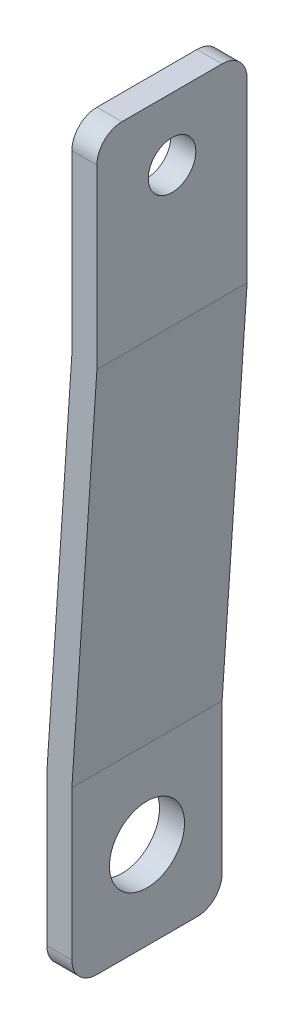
ISO-10303-21;
HEADER;
FILE_DESCRIPTION(('STEP AP214'),'2;1');
FILE_NAME('part.step','',(''),(''),'','','');
FILE_SCHEMA(('AUTOMOTIVE_DESIGN { 1 0 10303 214 1 1 1 1 }'));
ENDSEC;
DATA;
#1=APPLICATION_CONTEXT('core data for automotive mechanical design processes');
#2=APPLICATION_PROTOCOL_DEFINITION('international standard','automotive_design',2000,#1);
#3=PRODUCT_CONTEXT('',#1,'mechanical');
#4=PRODUCT('Part','Part','',(#3));
#5=PRODUCT_RELATED_PRODUCT_CATEGORY('part','',(#4));
#6=PRODUCT_DEFINITION_FORMATION('','',#4);
#7=PRODUCT_DEFINITION_CONTEXT('part definition',#1,'design');
#8=PRODUCT_DEFINITION('design','',#6,#7);
#9=PRODUCT_DEFINITION_SHAPE('','',#8);
#10=(LENGTH_UNIT() NAMED_UNIT(*) SI_UNIT(.MILLI.,.METRE.));
#11=(NAMED_UNIT(*) PLANE_ANGLE_UNIT() SI_UNIT($,.RADIAN.));
#12=(NAMED_UNIT(*) SI_UNIT($,.STERADIAN.) SOLID_ANGLE_UNIT());
#13=UNCERTAINTY_MEASURE_WITH_UNIT(LENGTH_MEASURE(1.E-05),#10,'distance_accuracy_value','');
#14=(GEOMETRIC_REPRESENTATION_CONTEXT(3) GLOBAL_UNCERTAINTY_ASSIGNED_CONTEXT((#13)) GLOBAL_UNIT_ASSIGNED_CONTEXT((#10,
#11,#12)) REPRESENTATION_CONTEXT('',''));
#15=CARTESIAN_POINT('',(0.,0.,0.));
#16=DIRECTION('',(0.,0.,1.));
#17=DIRECTION('',(1.,0.,0.));
#18=AXIS2_PLACEMENT_3D('',#15,#16,#17);
#19=CARTESIAN_POINT('',(-9.99999999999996,-229.999999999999,59.9999999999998));
#20=DIRECTION('',(0.999999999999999,0.,0.));
#21=DIRECTION('',(0.,1.,0.));
#22=AXIS2_PLACEMENT_3D('',#19,#20,#21);
#23=PLANE('',#22);
#24=CARTESIAN_POINT('',(-9.99999999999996,-265.000000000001,29.9999999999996));
#25=DIRECTION('',(0.999999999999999,0.,0.));
#26=DIRECTION('',(0.,1.,0.));
#27=AXIS2_PLACEMENT_3D('',#24,#25,#26);
#28=CIRCLE('',#27,15.);
#29=CARTESIAN_POINT('',(-9.99999999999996,-250.000000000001,29.9999999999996));
#30=VERTEX_POINT('',#29);
#31=EDGE_CURVE('E228',#30,#30,#28,.T.);
#32=ORIENTED_EDGE('',*,*,#31,.T.);
#33=EDGE_LOOP('',(#32));
#34=FACE_BOUND('',#33,.T.);
#35=DIRECTION('',(0.,-1.,0.));
#36=VECTOR('',#35,1.);
#37=CARTESIAN_POINT('',(-9.99999999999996,-230.,0.));
#38=LINE('',#37,#36);
#39=CARTESIAN_POINT('',(-9.99999999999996,-230.,0.));
#40=VERTEX_POINT('',#39);
#41=CARTESIAN_POINT('',(-9.99999999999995,-290.,2.22044604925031E-13));
#42=VERTEX_POINT('',#41);
#43=EDGE_CURVE('E156',#40,#42,#38,.T.);
#44=ORIENTED_EDGE('',*,*,#43,.T.);
#45=CARTESIAN_POINT('',(-9.99999999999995,-290.,9.99999999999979));
#46=DIRECTION('',(0.999999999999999,0.,0.));
#47=DIRECTION('',(0.,1.,0.));
#48=AXIS2_PLACEMENT_3D('',#45,#46,#47);
#49=CIRCLE('',#48,10.);
#50=CARTESIAN_POINT('',(-9.99999999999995,-300.,9.99999999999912));
#51=VERTEX_POINT('',#50);
#52=EDGE_CURVE('E204',#42,#51,#49,.F.);
#53=ORIENTED_EDGE('',*,*,#52,.T.);
#54=DIRECTION('',(0.,0.,-1.));
#55=VECTOR('',#54,1.);
#56=CARTESIAN_POINT('',(-9.99999999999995,-300.,60.0000000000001));
#57=LINE('',#56,#55);
#58=CARTESIAN_POINT('',(-9.99999999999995,-300.,49.9999999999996));
#59=VERTEX_POINT('',#58);
#60=EDGE_CURVE('E195',#59,#51,#57,.T.);
#61=ORIENTED_EDGE('',*,*,#60,.F.);
#62=CARTESIAN_POINT('',(-9.99999999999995,-290.,50.));
#63=DIRECTION('',(0.999999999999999,0.,0.));
#64=DIRECTION('',(0.,1.,0.));
#65=AXIS2_PLACEMENT_3D('',#62,#63,#64);
#66=CIRCLE('',#65,10.);
#67=CARTESIAN_POINT('',(-9.99999999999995,-289.999999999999,59.9999999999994));
#68=VERTEX_POINT('',#67);
#69=EDGE_CURVE('E202',#59,#68,#66,.F.);
#70=ORIENTED_EDGE('',*,*,#69,.T.);
#71=DIRECTION('',(0.,-1.,0.));
#72=VECTOR('',#71,1.);
#73=CARTESIAN_POINT('',(-9.99999999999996,-229.999999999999,59.9999999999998));
#74=LINE('',#73,#72);
#75=CARTESIAN_POINT('',(-9.99999999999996,-229.999999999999,59.9999999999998));
#76=VERTEX_POINT('',#75);
#77=EDGE_CURVE('E171',#76,#68,#74,.T.);
#78=ORIENTED_EDGE('',*,*,#77,.F.);
#79=DIRECTION('',(0.,0.,-1.));
#80=VECTOR('',#79,1.);
#81=CARTESIAN_POINT('',(-9.99999999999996,-229.999999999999,59.9999999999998));
#82=LINE('',#81,#80);
#83=EDGE_CURVE('E183',#76,#40,#82,.T.);
#84=ORIENTED_EDGE('',*,*,#83,.T.);
#85=EDGE_LOOP('',(#44,#53,#61,#70,#78,#84));
#86=FACE_BOUND('',#85,.T.);
#87=ADVANCED_FACE('F43',(#34,#86),#23,.F.);
#88=CARTESIAN_POINT('',(0.,-300.,60.0000000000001));
#89=DIRECTION('',(0.,-1.,0.));
#90=DIRECTION('',(0.,0.,-1.));
#91=AXIS2_PLACEMENT_3D('',#88,#89,#90);
#92=PLANE('',#91);
#93=ORIENTED_EDGE('',*,*,#60,.T.);
#94=DIRECTION('',(-0.999999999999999,0.,0.));
#95=VECTOR('',#94,1.);
#96=CARTESIAN_POINT('',(0.,-300.,9.99999999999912));
#97=LINE('',#96,#95);
#98=CARTESIAN_POINT('',(0.,-300.,9.99999999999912));
#99=VERTEX_POINT('',#98);
#100=EDGE_CURVE('E209',#51,#99,#97,.F.);
#101=ORIENTED_EDGE('',*,*,#100,.T.);
#102=DIRECTION('',(0.,0.,-1.));
#103=VECTOR('',#102,1.);
#104=CARTESIAN_POINT('',(0.,-300.,60.0000000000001));
#105=LINE('',#104,#103);
#106=CARTESIAN_POINT('',(0.,-300.,49.9999999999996));
#107=VERTEX_POINT('',#106);
#108=EDGE_CURVE('E144',#107,#99,#105,.T.);
#109=ORIENTED_EDGE('',*,*,#108,.F.);
#110=DIRECTION('',(-0.999999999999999,0.,0.));
#111=VECTOR('',#110,1.);
#112=CARTESIAN_POINT('',(-9.99999999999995,-300.,49.9999999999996));
#113=LINE('',#112,#111);
#114=EDGE_CURVE('E206',#107,#59,#113,.T.);
#115=ORIENTED_EDGE('',*,*,#114,.T.);
#116=EDGE_LOOP('',(#93,#101,#109,#115));
#117=FACE_BOUND('',#116,.T.);
#118=ADVANCED_FACE('F263',(#117),#92,.T.);
#119=CARTESIAN_POINT('',(0.,-229.999999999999,59.9999999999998));
#120=DIRECTION('',(0.999999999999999,0.,0.));
#121=DIRECTION('',(0.,1.,0.));
#122=AXIS2_PLACEMENT_3D('',#119,#120,#121);
#123=PLANE('',#122);
#124=CARTESIAN_POINT('',(0.,-265.000000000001,29.9999999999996));
#125=DIRECTION('',(0.999999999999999,0.,0.));
#126=DIRECTION('',(0.,1.,0.));
#127=AXIS2_PLACEMENT_3D('',#124,#125,#126);
#128=CIRCLE('',#127,15.);
#129=CARTESIAN_POINT('',(0.,-250.000000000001,29.9999999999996));
#130=VERTEX_POINT('',#129);
#131=EDGE_CURVE('E226',#130,#130,#128,.T.);
#132=ORIENTED_EDGE('',*,*,#131,.F.);
#133=EDGE_LOOP('',(#132));
#134=FACE_BOUND('',#133,.T.);
#135=ORIENTED_EDGE('',*,*,#108,.T.);
#136=CARTESIAN_POINT('',(0.,-290.,9.99999999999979));
#137=DIRECTION('',(0.999999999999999,0.,0.));
#138=DIRECTION('',(0.,1.,0.));
#139=AXIS2_PLACEMENT_3D('',#136,#137,#138);
#140=CIRCLE('',#139,10.);
#141=CARTESIAN_POINT('',(0.,-290.,2.22044604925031E-13));
#142=VERTEX_POINT('',#141);
#143=EDGE_CURVE('E152',#99,#142,#140,.T.);
#144=ORIENTED_EDGE('',*,*,#143,.T.);
#145=DIRECTION('',(0.,-1.,0.));
#146=VECTOR('',#145,1.);
#147=CARTESIAN_POINT('',(0.,-230.,0.));
#148=LINE('',#147,#146);
#149=CARTESIAN_POINT('',(0.,-230.333704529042,-8.88178419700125E-13));
#150=VERTEX_POINT('',#149);
#151=EDGE_CURVE('E148',#150,#142,#148,.T.);
#152=ORIENTED_EDGE('',*,*,#151,.F.);
#153=DIRECTION('',(0.,0.,-1.));
#154=VECTOR('',#153,1.);
#155=CARTESIAN_POINT('',(0.,-230.333704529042,59.9999999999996));
#156=LINE('',#155,#154);
#157=CARTESIAN_POINT('',(0.,-230.333704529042,59.9999999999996));
#158=VERTEX_POINT('',#157);
#159=EDGE_CURVE('E133',#158,#150,#156,.T.);
#160=ORIENTED_EDGE('',*,*,#159,.F.);
#161=DIRECTION('',(0.,-1.,0.));
#162=VECTOR('',#161,1.);
#163=CARTESIAN_POINT('',(0.,-229.999999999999,59.9999999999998));
#164=LINE('',#163,#162);
#165=CARTESIAN_POINT('',(0.,-289.999999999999,59.9999999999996));
#166=VERTEX_POINT('',#165);
#167=EDGE_CURVE('E174',#158,#166,#164,.T.);
#168=ORIENTED_EDGE('',*,*,#167,.T.);
#169=CARTESIAN_POINT('',(0.,-290.,50.));
#170=DIRECTION('',(0.999999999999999,0.,0.));
#171=DIRECTION('',(0.,1.,0.));
#172=AXIS2_PLACEMENT_3D('',#169,#170,#171);
#173=CIRCLE('',#172,10.);
#174=EDGE_CURVE('E211',#166,#107,#173,.T.);
#175=ORIENTED_EDGE('',*,*,#174,.T.);
#176=EDGE_LOOP('',(#135,#144,#152,#160,#168,#175));
#177=FACE_BOUND('',#176,.T.);
#178=ADVANCED_FACE('F150',(#134,#177),#123,.T.);
#179=CARTESIAN_POINT('',(9.97775303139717,-81.0003711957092,60.0000000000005));
#180=DIRECTION('',(0.997775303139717,-0.0666666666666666,0.));
#181=DIRECTION('',(0.0666666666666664,0.997775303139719,0.));
#182=AXIS2_PLACEMENT_3D('',#179,#180,#181);
#183=PLANE('',#182);
#184=DIRECTION('',(-0.0666666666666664,-0.997775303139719,0.));
#185=VECTOR('',#184,1.);
#186=CARTESIAN_POINT('',(9.97775303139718,-81.0003711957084,4.44089209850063E-13));
#187=LINE('',#186,#185);
#188=CARTESIAN_POINT('',(9.99999999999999,-80.6674090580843,0.));
#189=VERTEX_POINT('',#188);
#190=EDGE_CURVE('E138',#189,#150,#187,.T.);
#191=ORIENTED_EDGE('',*,*,#190,.F.);
#192=DIRECTION('',(0.,0.,-1.));
#193=VECTOR('',#192,1.);
#194=CARTESIAN_POINT('',(10.,-80.6674090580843,60.0000000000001));
#195=LINE('',#194,#193);
#196=CARTESIAN_POINT('',(10.,-80.6674090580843,60.0000000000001));
#197=VERTEX_POINT('',#196);
#198=EDGE_CURVE('E145',#197,#189,#195,.T.);
#199=ORIENTED_EDGE('',*,*,#198,.F.);
#200=DIRECTION('',(-0.0666666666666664,-0.997775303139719,0.));
#201=VECTOR('',#200,1.);
#202=CARTESIAN_POINT('',(9.97775303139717,-81.0003711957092,60.0000000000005));
#203=LINE('',#202,#201);
#204=EDGE_CURVE('E140',#197,#158,#203,.T.);
#205=ORIENTED_EDGE('',*,*,#204,.T.);
#206=ORIENTED_EDGE('',*,*,#159,.T.);
#207=EDGE_LOOP('',(#191,#199,#205,#206));
#208=FACE_BOUND('',#207,.T.);
#209=ADVANCED_FACE('F135',(#208),#183,.T.);
#210=CARTESIAN_POINT('',(10.,0.,60.0000000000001));
#211=DIRECTION('',(0.999999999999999,0.,0.));
#212=DIRECTION('',(0.,0.,-1.));
#213=AXIS2_PLACEMENT_3D('',#210,#211,#212);
#214=PLANE('',#213);
#215=CARTESIAN_POINT('',(10.,-24.9999999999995,30.));
#216=DIRECTION('',(0.999999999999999,0.,0.));
#217=DIRECTION('',(0.,1.,0.));
#218=AXIS2_PLACEMENT_3D('',#215,#216,#217);
#219=CIRCLE('',#218,9.5);
#220=CARTESIAN_POINT('',(10.,-15.4999999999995,30.));
#221=VERTEX_POINT('',#220);
#222=EDGE_CURVE('E237',#221,#221,#219,.T.);
#223=ORIENTED_EDGE('',*,*,#222,.F.);
#224=EDGE_LOOP('',(#223));
#225=FACE_BOUND('',#224,.T.);
#226=DIRECTION('',(0.,1.,0.));
#227=VECTOR('',#226,1.);
#228=CARTESIAN_POINT('',(10.,0.,0.));
#229=LINE('',#228,#227);
#230=CARTESIAN_POINT('',(10.,-9.99999999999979,-6.66133814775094E-13));
#231=VERTEX_POINT('',#230);
#232=EDGE_CURVE('E161',#231,#189,#229,.F.);
#233=ORIENTED_EDGE('',*,*,#232,.F.);
#234=CARTESIAN_POINT('',(10.,-9.99999999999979,10.));
#235=DIRECTION('',(0.999999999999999,0.,0.));
#236=DIRECTION('',(0.,0.,-1.));
#237=AXIS2_PLACEMENT_3D('',#234,#235,#236);
#238=CIRCLE('',#237,10.);
#239=CARTESIAN_POINT('',(9.99999999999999,0.,9.99999999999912));
#240=VERTEX_POINT('',#239);
#241=EDGE_CURVE('E220',#231,#240,#238,.T.);
#242=ORIENTED_EDGE('',*,*,#241,.T.);
#243=DIRECTION('',(0.,0.,-1.));
#244=VECTOR('',#243,1.);
#245=CARTESIAN_POINT('',(10.,0.,60.0000000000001));
#246=LINE('',#245,#244);
#247=CARTESIAN_POINT('',(10.,0.,49.9999999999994));
#248=VERTEX_POINT('',#247);
#249=EDGE_CURVE('E191',#248,#240,#246,.T.);
#250=ORIENTED_EDGE('',*,*,#249,.F.);
#251=CARTESIAN_POINT('',(10.,-9.99999999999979,50.));
#252=DIRECTION('',(0.999999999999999,0.,0.));
#253=DIRECTION('',(0.,0.,-1.));
#254=AXIS2_PLACEMENT_3D('',#251,#252,#253);
#255=CIRCLE('',#254,10.);
#256=CARTESIAN_POINT('',(10.,-9.99999999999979,59.9999999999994));
#257=VERTEX_POINT('',#256);
#258=EDGE_CURVE('E218',#248,#257,#255,.T.);
#259=ORIENTED_EDGE('',*,*,#258,.T.);
#260=DIRECTION('',(0.,1.,0.));
#261=VECTOR('',#260,1.);
#262=CARTESIAN_POINT('',(10.,0.,60.0000000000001));
#263=LINE('',#262,#261);
#264=EDGE_CURVE('E177',#257,#197,#263,.F.);
#265=ORIENTED_EDGE('',*,*,#264,.T.);
#266=ORIENTED_EDGE('',*,*,#198,.T.);
#267=EDGE_LOOP('',(#233,#242,#250,#259,#265,#266));
#268=FACE_BOUND('',#267,.T.);
#269=ADVANCED_FACE('F245',(#225,#268),#214,.T.);
#270=CARTESIAN_POINT('',(0.,0.,60.0000000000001));
#271=DIRECTION('',(0.,1.,0.));
#272=DIRECTION('',(0.,0.,1.));
#273=AXIS2_PLACEMENT_3D('',#270,#271,#272);
#274=PLANE('',#273);
#275=ORIENTED_EDGE('',*,*,#249,.T.);
#276=DIRECTION('',(0.999999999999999,0.,0.));
#277=VECTOR('',#276,1.);
#278=CARTESIAN_POINT('',(0.,0.,9.99999999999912));
#279=LINE('',#278,#277);
#280=CARTESIAN_POINT('',(0.,0.,9.99999999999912));
#281=VERTEX_POINT('',#280);
#282=EDGE_CURVE('E59',#240,#281,#279,.F.);
#283=ORIENTED_EDGE('',*,*,#282,.T.);
#284=DIRECTION('',(0.,0.,-1.));
#285=VECTOR('',#284,1.);
#286=CARTESIAN_POINT('',(0.,0.,60.0000000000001));
#287=LINE('',#286,#285);
#288=CARTESIAN_POINT('',(0.,0.,49.9999999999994));
#289=VERTEX_POINT('',#288);
#290=EDGE_CURVE('E189',#289,#281,#287,.T.);
#291=ORIENTED_EDGE('',*,*,#290,.F.);
#292=DIRECTION('',(0.999999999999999,0.,0.));
#293=VECTOR('',#292,1.);
#294=CARTESIAN_POINT('',(10.,0.,49.9999999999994));
#295=LINE('',#294,#293);
#296=EDGE_CURVE('E222',#289,#248,#295,.T.);
#297=ORIENTED_EDGE('',*,*,#296,.T.);
#298=EDGE_LOOP('',(#275,#283,#291,#297));
#299=FACE_BOUND('',#298,.T.);
#300=ADVANCED_FACE('F248',(#299),#274,.T.);
#301=CARTESIAN_POINT('',(0.,0.,60.0000000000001));
#302=DIRECTION('',(0.999999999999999,0.,0.));
#303=DIRECTION('',(0.,0.,-1.));
#304=AXIS2_PLACEMENT_3D('',#301,#302,#303);
#305=PLANE('',#304);
#306=CARTESIAN_POINT('',(0.,-24.9999999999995,30.));
#307=DIRECTION('',(0.999999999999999,0.,0.));
#308=DIRECTION('',(0.,0.,-1.));
#309=AXIS2_PLACEMENT_3D('',#306,#307,#308);
#310=CIRCLE('',#309,9.5);
#311=CARTESIAN_POINT('',(0.,-15.4999999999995,30.));
#312=VERTEX_POINT('',#311);
#313=EDGE_CURVE('E46',#312,#312,#310,.T.);
#314=ORIENTED_EDGE('',*,*,#313,.T.);
#315=EDGE_LOOP('',(#314));
#316=FACE_BOUND('',#315,.T.);
#317=ORIENTED_EDGE('',*,*,#290,.T.);
#318=CARTESIAN_POINT('',(0.,-9.99999999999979,10.));
#319=DIRECTION('',(0.999999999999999,0.,0.));
#320=DIRECTION('',(0.,0.,-1.));
#321=AXIS2_PLACEMENT_3D('',#318,#319,#320);
#322=CIRCLE('',#321,10.);
#323=CARTESIAN_POINT('',(0.,-9.99999999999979,-4.44089209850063E-13));
#324=VERTEX_POINT('',#323);
#325=EDGE_CURVE('E13',#281,#324,#322,.F.);
#326=ORIENTED_EDGE('',*,*,#325,.T.);
#327=DIRECTION('',(0.,-1.,0.));
#328=VECTOR('',#327,1.);
#329=CARTESIAN_POINT('',(0.,0.,0.));
#330=LINE('',#329,#328);
#331=CARTESIAN_POINT('',(0.,-80.3337045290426,2.22044604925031E-13));
#332=VERTEX_POINT('',#331);
#333=EDGE_CURVE('E164',#324,#332,#330,.T.);
#334=ORIENTED_EDGE('',*,*,#333,.T.);
#335=DIRECTION('',(0.,0.,-1.));
#336=VECTOR('',#335,1.);
#337=CARTESIAN_POINT('',(0.,-80.3337045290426,59.9999999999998));
#338=LINE('',#337,#336);
#339=CARTESIAN_POINT('',(0.,-80.3337045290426,59.9999999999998));
#340=VERTEX_POINT('',#339);
#341=EDGE_CURVE('E186',#340,#332,#338,.T.);
#342=ORIENTED_EDGE('',*,*,#341,.F.);
#343=DIRECTION('',(0.,-1.,0.));
#344=VECTOR('',#343,1.);
#345=CARTESIAN_POINT('',(0.,0.,60.0000000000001));
#346=LINE('',#345,#344);
#347=CARTESIAN_POINT('',(0.,-9.99999999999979,59.9999999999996));
#348=VERTEX_POINT('',#347);
#349=EDGE_CURVE('E179',#348,#340,#346,.T.);
#350=ORIENTED_EDGE('',*,*,#349,.F.);
#351=CARTESIAN_POINT('',(0.,-9.99999999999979,50.));
#352=DIRECTION('',(0.999999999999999,0.,0.));
#353=DIRECTION('',(0.,0.,-1.));
#354=AXIS2_PLACEMENT_3D('',#351,#352,#353);
#355=CIRCLE('',#354,10.);
#356=EDGE_CURVE('E51',#348,#289,#355,.F.);
#357=ORIENTED_EDGE('',*,*,#356,.T.);
#358=EDGE_LOOP('',(#317,#326,#334,#342,#350,#357));
#359=FACE_BOUND('',#358,.T.);
#360=ADVANCED_FACE('F278',(#316,#359),#305,.F.);
#361=CARTESIAN_POINT('',(0.,-80.3337045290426,59.9999999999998));
#362=DIRECTION('',(0.997775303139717,-0.0666666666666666,0.));
#363=DIRECTION('',(0.0666666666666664,0.997775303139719,0.));
#364=AXIS2_PLACEMENT_3D('',#361,#362,#363);
#365=PLANE('',#364);
#366=DIRECTION('',(-0.0666666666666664,-0.997775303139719,0.));
#367=VECTOR('',#366,1.);
#368=CARTESIAN_POINT('',(0.,-80.3337045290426,2.22044604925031E-13));
#369=LINE('',#368,#367);
#370=EDGE_CURVE('E169',#332,#40,#369,.T.);
#371=ORIENTED_EDGE('',*,*,#370,.T.);
#372=ORIENTED_EDGE('',*,*,#83,.F.);
#373=DIRECTION('',(-0.0666666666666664,-0.997775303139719,0.));
#374=VECTOR('',#373,1.);
#375=CARTESIAN_POINT('',(0.,-80.3337045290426,59.9999999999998));
#376=LINE('',#375,#374);
#377=EDGE_CURVE('E181',#340,#76,#376,.T.);
#378=ORIENTED_EDGE('',*,*,#377,.F.);
#379=ORIENTED_EDGE('',*,*,#341,.T.);
#380=EDGE_LOOP('',(#371,#372,#378,#379));
#381=FACE_BOUND('',#380,.T.);
#382=ADVANCED_FACE('F275',(#381),#365,.F.);
#383=CARTESIAN_POINT('',(-9.99999999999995,-300.,60.0000000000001));
#384=DIRECTION('',(0.,0.,-1.));
#385=DIRECTION('',(-0.999999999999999,0.,0.));
#386=AXIS2_PLACEMENT_3D('',#383,#384,#385);
#387=PLANE('',#386);
#388=ORIENTED_EDGE('',*,*,#77,.T.);
#389=DIRECTION('',(-0.999999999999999,0.,0.));
#390=VECTOR('',#389,1.);
#391=CARTESIAN_POINT('',(0.,-289.999999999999,59.9999999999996));
#392=LINE('',#391,#390);
#393=EDGE_CURVE('E216',#68,#166,#392,.F.);
#394=ORIENTED_EDGE('',*,*,#393,.T.);
#395=ORIENTED_EDGE('',*,*,#167,.F.);
#396=ORIENTED_EDGE('',*,*,#204,.F.);
#397=ORIENTED_EDGE('',*,*,#264,.F.);
#398=DIRECTION('',(0.999999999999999,0.,0.));
#399=VECTOR('',#398,1.);
#400=CARTESIAN_POINT('',(0.,-9.99999999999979,59.9999999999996));
#401=LINE('',#400,#399);
#402=EDGE_CURVE('E214',#257,#348,#401,.F.);
#403=ORIENTED_EDGE('',*,*,#402,.T.);
#404=ORIENTED_EDGE('',*,*,#349,.T.);
#405=ORIENTED_EDGE('',*,*,#377,.T.);
#406=EDGE_LOOP('',(#388,#394,#395,#396,#397,#403,#404,#405));
#407=FACE_BOUND('',#406,.T.);
#408=ADVANCED_FACE('F253',(#407),#387,.F.);
#409=CARTESIAN_POINT('',(-9.99999999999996,-300.,0.));
#410=DIRECTION('',(0.,0.,-1.));
#411=DIRECTION('',(-0.999999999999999,0.,0.));
#412=AXIS2_PLACEMENT_3D('',#409,#410,#411);
#413=PLANE('',#412);
#414=ORIENTED_EDGE('',*,*,#151,.T.);
#415=DIRECTION('',(-0.999999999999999,0.,0.));
#416=VECTOR('',#415,1.);
#417=CARTESIAN_POINT('',(-9.99999999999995,-290.,2.22044604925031E-13));
#418=LINE('',#417,#416);
#419=EDGE_CURVE('E200',#142,#42,#418,.T.);
#420=ORIENTED_EDGE('',*,*,#419,.T.);
#421=ORIENTED_EDGE('',*,*,#43,.F.);
#422=ORIENTED_EDGE('',*,*,#370,.F.);
#423=ORIENTED_EDGE('',*,*,#333,.F.);
#424=DIRECTION('',(0.999999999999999,0.,0.));
#425=VECTOR('',#424,1.);
#426=CARTESIAN_POINT('',(-9.99999999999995,-9.99999999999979,-4.44089209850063E-13));
#427=LINE('',#426,#425);
#428=EDGE_CURVE('E198',#324,#231,#427,.T.);
#429=ORIENTED_EDGE('',*,*,#428,.T.);
#430=ORIENTED_EDGE('',*,*,#232,.T.);
#431=ORIENTED_EDGE('',*,*,#190,.T.);
#432=EDGE_LOOP('',(#414,#420,#421,#422,#423,#429,#430,#431));
#433=FACE_BOUND('',#432,.T.);
#434=ADVANCED_FACE('F158',(#433),#413,.T.);
#435=CARTESIAN_POINT('',(-9.99999999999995,-290.,9.99999999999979));
#436=DIRECTION('',(-0.999999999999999,0.,0.));
#437=DIRECTION('',(0.,0.,1.));
#438=AXIS2_PLACEMENT_3D('',#435,#436,#437);
#439=CYLINDRICAL_SURFACE('',#438,10.);
#440=ORIENTED_EDGE('',*,*,#143,.F.);
#441=ORIENTED_EDGE('',*,*,#100,.F.);
#442=ORIENTED_EDGE('',*,*,#52,.F.);
#443=ORIENTED_EDGE('',*,*,#419,.F.);
#444=EDGE_LOOP('',(#440,#441,#442,#443));
#445=FACE_BOUND('',#444,.T.);
#446=ADVANCED_FACE('F269',(#445),#439,.T.);
#447=CARTESIAN_POINT('',(0.,-290.,50.));
#448=DIRECTION('',(0.999999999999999,0.,0.));
#449=DIRECTION('',(0.,0.,-1.));
#450=AXIS2_PLACEMENT_3D('',#447,#448,#449);
#451=CYLINDRICAL_SURFACE('',#450,10.);
#452=ORIENTED_EDGE('',*,*,#174,.F.);
#453=ORIENTED_EDGE('',*,*,#393,.F.);
#454=ORIENTED_EDGE('',*,*,#69,.F.);
#455=ORIENTED_EDGE('',*,*,#114,.F.);
#456=EDGE_LOOP('',(#452,#453,#454,#455));
#457=FACE_BOUND('',#456,.T.);
#458=ADVANCED_FACE('F260',(#457),#451,.T.);
#459=CARTESIAN_POINT('',(-9.99999999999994,-9.99999999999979,10.));
#460=DIRECTION('',(0.999999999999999,0.,0.));
#461=DIRECTION('',(0.,0.,-1.));
#462=AXIS2_PLACEMENT_3D('',#459,#460,#461);
#463=CYLINDRICAL_SURFACE('',#462,10.);
#464=ORIENTED_EDGE('',*,*,#325,.F.);
#465=ORIENTED_EDGE('',*,*,#282,.F.);
#466=ORIENTED_EDGE('',*,*,#241,.F.);
#467=ORIENTED_EDGE('',*,*,#428,.F.);
#468=EDGE_LOOP('',(#464,#465,#466,#467));
#469=FACE_BOUND('',#468,.T.);
#470=ADVANCED_FACE('F281',(#469),#463,.T.);
#471=CARTESIAN_POINT('',(0.,-9.99999999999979,50.));
#472=DIRECTION('',(-0.999999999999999,0.,0.));
#473=DIRECTION('',(0.,0.,1.));
#474=AXIS2_PLACEMENT_3D('',#471,#472,#473);
#475=CYLINDRICAL_SURFACE('',#474,10.);
#476=ORIENTED_EDGE('',*,*,#356,.F.);
#477=ORIENTED_EDGE('',*,*,#402,.F.);
#478=ORIENTED_EDGE('',*,*,#258,.F.);
#479=ORIENTED_EDGE('',*,*,#296,.F.);
#480=EDGE_LOOP('',(#476,#477,#478,#479));
#481=FACE_BOUND('',#480,.T.);
#482=ADVANCED_FACE('F283',(#481),#475,.T.);
#483=CARTESIAN_POINT('',(-9.99999999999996,-265.000000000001,29.9999999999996));
#484=DIRECTION('',(0.999999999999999,0.,0.));
#485=DIRECTION('',(0.,1.,0.));
#486=AXIS2_PLACEMENT_3D('',#483,#484,#485);
#487=CYLINDRICAL_SURFACE('',#486,15.);
#488=CARTESIAN_POINT('',(0.,-250.000000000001,29.9999999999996));
#489=CARTESIAN_POINT('',(-0.104166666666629,-250.000000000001,29.9999999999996));
#490=CARTESIAN_POINT('',(-0.208333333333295,-250.000000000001,29.9999999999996));
#491=CARTESIAN_POINT('',(-0.416666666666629,-250.000000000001,29.9999999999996));
#492=CARTESIAN_POINT('',(-0.520833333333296,-250.000000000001,29.9999999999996));
#493=CARTESIAN_POINT('',(-0.729166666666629,-250.000000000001,29.9999999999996));
#494=CARTESIAN_POINT('',(-0.833333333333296,-250.000000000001,29.9999999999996));
#495=CARTESIAN_POINT('',(-1.04166666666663,-250.000000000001,29.9999999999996));
#496=CARTESIAN_POINT('',(-1.1458333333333,-250.000000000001,29.9999999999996));
#497=CARTESIAN_POINT('',(-1.35416666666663,-250.000000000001,29.9999999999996));
#498=CARTESIAN_POINT('',(-1.45833333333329,-250.000000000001,29.9999999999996));
#499=CARTESIAN_POINT('',(-1.66666666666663,-250.000000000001,29.9999999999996));
#500=CARTESIAN_POINT('',(-1.7708333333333,-250.000000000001,29.9999999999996));
#501=CARTESIAN_POINT('',(-1.97916666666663,-250.000000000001,29.9999999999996));
#502=CARTESIAN_POINT('',(-2.0833333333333,-250.000000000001,29.9999999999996));
#503=CARTESIAN_POINT('',(-2.29166666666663,-250.000000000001,29.9999999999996));
#504=CARTESIAN_POINT('',(-2.3958333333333,-250.000000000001,29.9999999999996));
#505=CARTESIAN_POINT('',(-2.60416666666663,-250.000000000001,29.9999999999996));
#506=CARTESIAN_POINT('',(-2.7083333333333,-250.000000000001,29.9999999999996));
#507=CARTESIAN_POINT('',(-2.91666666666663,-250.000000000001,29.9999999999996));
#508=CARTESIAN_POINT('',(-3.0208333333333,-250.000000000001,29.9999999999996));
#509=CARTESIAN_POINT('',(-3.22916666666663,-250.000000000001,29.9999999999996));
#510=CARTESIAN_POINT('',(-3.3333333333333,-250.000000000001,29.9999999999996));
#511=CARTESIAN_POINT('',(-3.54166666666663,-250.000000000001,29.9999999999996));
#512=CARTESIAN_POINT('',(-3.6458333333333,-250.000000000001,29.9999999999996));
#513=CARTESIAN_POINT('',(-3.85416666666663,-250.000000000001,29.9999999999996));
#514=CARTESIAN_POINT('',(-3.9583333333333,-250.000000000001,29.9999999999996));
#515=CARTESIAN_POINT('',(-4.16666666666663,-250.000000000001,29.9999999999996));
#516=CARTESIAN_POINT('',(-4.2708333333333,-250.000000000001,29.9999999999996));
#517=CARTESIAN_POINT('',(-4.47916666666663,-250.000000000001,29.9999999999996));
#518=CARTESIAN_POINT('',(-4.58333333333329,-250.000000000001,29.9999999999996));
#519=CARTESIAN_POINT('',(-4.79166666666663,-250.000000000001,29.9999999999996));
#520=CARTESIAN_POINT('',(-4.8958333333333,-250.000000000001,29.9999999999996));
#521=CARTESIAN_POINT('',(-5.10416666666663,-250.000000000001,29.9999999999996));
#522=CARTESIAN_POINT('',(-5.2083333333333,-250.000000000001,29.9999999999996));
#523=CARTESIAN_POINT('',(-5.41666666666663,-250.000000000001,29.9999999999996));
#524=CARTESIAN_POINT('',(-5.52083333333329,-250.000000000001,29.9999999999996));
#525=CARTESIAN_POINT('',(-5.72916666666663,-250.000000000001,29.9999999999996));
#526=CARTESIAN_POINT('',(-5.8333333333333,-250.000000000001,29.9999999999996));
#527=CARTESIAN_POINT('',(-6.04166666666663,-250.000000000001,29.9999999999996));
#528=CARTESIAN_POINT('',(-6.1458333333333,-250.000000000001,29.9999999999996));
#529=CARTESIAN_POINT('',(-6.35416666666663,-250.000000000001,29.9999999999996));
#530=CARTESIAN_POINT('',(-6.4583333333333,-250.000000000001,29.9999999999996));
#531=CARTESIAN_POINT('',(-6.66666666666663,-250.000000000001,29.9999999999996));
#532=CARTESIAN_POINT('',(-6.7708333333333,-250.000000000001,29.9999999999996));
#533=CARTESIAN_POINT('',(-6.97916666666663,-250.000000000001,29.9999999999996));
#534=CARTESIAN_POINT('',(-7.0833333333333,-250.000000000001,29.9999999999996));
#535=CARTESIAN_POINT('',(-7.29166666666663,-250.000000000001,29.9999999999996));
#536=CARTESIAN_POINT('',(-7.39583333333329,-250.000000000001,29.9999999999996));
#537=CARTESIAN_POINT('',(-7.60416666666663,-250.000000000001,29.9999999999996));
#538=CARTESIAN_POINT('',(-7.7083333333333,-250.000000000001,29.9999999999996));
#539=CARTESIAN_POINT('',(-7.91666666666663,-250.000000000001,29.9999999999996));
#540=CARTESIAN_POINT('',(-8.02083333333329,-250.000000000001,29.9999999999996));
#541=CARTESIAN_POINT('',(-8.22916666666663,-250.000000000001,29.9999999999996));
#542=CARTESIAN_POINT('',(-8.33333333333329,-250.000000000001,29.9999999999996));
#543=CARTESIAN_POINT('',(-8.54166666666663,-250.000000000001,29.9999999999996));
#544=CARTESIAN_POINT('',(-8.64583333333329,-250.000000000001,29.9999999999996));
#545=CARTESIAN_POINT('',(-8.85416666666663,-250.000000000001,29.9999999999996));
#546=CARTESIAN_POINT('',(-8.95833333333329,-250.000000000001,29.9999999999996));
#547=CARTESIAN_POINT('',(-9.16666666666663,-250.000000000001,29.9999999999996));
#548=CARTESIAN_POINT('',(-9.2708333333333,-250.000000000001,29.9999999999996));
#549=CARTESIAN_POINT('',(-9.47916666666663,-250.000000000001,29.9999999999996));
#550=CARTESIAN_POINT('',(-9.58333333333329,-250.000000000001,29.9999999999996));
#551=CARTESIAN_POINT('',(-9.79166666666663,-250.000000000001,29.9999999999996));
#552=CARTESIAN_POINT('',(-9.89583333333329,-250.000000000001,29.9999999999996));
#553=CARTESIAN_POINT('',(-9.99999999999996,-250.000000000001,29.9999999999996));
#554=B_SPLINE_CURVE_WITH_KNOTS('',3,(#488,#489,#490,#491,#492,#493,#494,#495,#496,#497,#498,
#499,#500,#501,#502,#503,#504,#505,#506,#507,#508,#509,#510,#511,#512,#513,#514,#515,#516,#517,
#518,#519,#520,#521,#522,#523,#524,#525,#526,#527,#528,#529,#530,#531,#532,#533,#534,#535,#536,
#537,#538,#539,#540,#541,#542,#543,#544,#545,#546,#547,#548,#549,#550,#551,#552,#553),
.UNSPECIFIED.,.F.,.F.,(4,2,2,2,2,2,2,2,2,2,2,2,2,2,2,2,2,2,2,2,2,2,2,2,2,2,2,2,2,2,2,2,4),(0.,
0.3125,0.625000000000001,0.937500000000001,1.25,1.5625,1.875,2.1875,2.5,2.8125,3.125,3.4375,
3.75,4.0625,4.375,4.6875,5.,5.3125,5.625,5.9375,6.25,6.5625,6.875,7.1875,7.5,7.8125,8.125,
8.4375,8.75,9.0625,9.375,9.6875,10.),.UNSPECIFIED.);
#555=EDGE_CURVE('BSEAM289',#130,#30,#554,.T.);
#556=ORIENTED_EDGE('',*,*,#131,.T.);
#557=ORIENTED_EDGE('',*,*,#31,.F.);
#558=ORIENTED_EDGE('',*,*,#555,.T.);
#559=ORIENTED_EDGE('',*,*,#555,.F.);
#560=EDGE_LOOP('',(#556,#558,#557,#559));
#561=FACE_BOUND('',#560,.T.);
#562=ADVANCED_FACE('F289',(#561),#487,.F.);
#563=CARTESIAN_POINT('',(-9.99999999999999,-24.9999999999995,30.));
#564=DIRECTION('',(0.999999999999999,0.,0.));
#565=DIRECTION('',(0.,1.,0.));
#566=AXIS2_PLACEMENT_3D('',#563,#564,#565);
#567=CYLINDRICAL_SURFACE('',#566,9.5);
#568=CARTESIAN_POINT('',(10.,-15.4999999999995,30.));
#569=CARTESIAN_POINT('',(9.89583333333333,-15.4999999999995,30.));
#570=CARTESIAN_POINT('',(9.79166666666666,-15.4999999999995,30.));
#571=CARTESIAN_POINT('',(9.58333333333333,-15.4999999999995,30.));
#572=CARTESIAN_POINT('',(9.47916666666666,-15.4999999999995,30.));
#573=CARTESIAN_POINT('',(9.27083333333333,-15.4999999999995,30.));
#574=CARTESIAN_POINT('',(9.16666666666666,-15.4999999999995,30.));
#575=CARTESIAN_POINT('',(8.95833333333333,-15.4999999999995,30.));
#576=CARTESIAN_POINT('',(8.85416666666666,-15.4999999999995,30.));
#577=CARTESIAN_POINT('',(8.64583333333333,-15.4999999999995,30.));
#578=CARTESIAN_POINT('',(8.54166666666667,-15.4999999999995,30.));
#579=CARTESIAN_POINT('',(8.33333333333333,-15.4999999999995,30.));
#580=CARTESIAN_POINT('',(8.22916666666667,-15.4999999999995,30.));
#581=CARTESIAN_POINT('',(8.02083333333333,-15.4999999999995,30.));
#582=CARTESIAN_POINT('',(7.91666666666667,-15.4999999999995,30.));
#583=CARTESIAN_POINT('',(7.70833333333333,-15.4999999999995,30.));
#584=CARTESIAN_POINT('',(7.60416666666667,-15.4999999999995,30.));
#585=CARTESIAN_POINT('',(7.39583333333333,-15.4999999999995,30.));
#586=CARTESIAN_POINT('',(7.29166666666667,-15.4999999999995,30.));
#587=CARTESIAN_POINT('',(7.08333333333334,-15.4999999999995,30.));
#588=CARTESIAN_POINT('',(6.97916666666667,-15.4999999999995,30.));
#589=CARTESIAN_POINT('',(6.77083333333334,-15.4999999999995,30.));
#590=CARTESIAN_POINT('',(6.66666666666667,-15.4999999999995,30.));
#591=CARTESIAN_POINT('',(6.45833333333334,-15.4999999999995,30.));
#592=CARTESIAN_POINT('',(6.35416666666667,-15.4999999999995,30.));
#593=CARTESIAN_POINT('',(6.14583333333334,-15.4999999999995,30.));
#594=CARTESIAN_POINT('',(6.04166666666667,-15.4999999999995,30.));
#595=CARTESIAN_POINT('',(5.83333333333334,-15.4999999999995,30.));
#596=CARTESIAN_POINT('',(5.72916666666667,-15.4999999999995,30.));
#597=CARTESIAN_POINT('',(5.52083333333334,-15.4999999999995,30.));
#598=CARTESIAN_POINT('',(5.41666666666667,-15.4999999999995,30.));
#599=CARTESIAN_POINT('',(5.20833333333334,-15.4999999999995,30.));
#600=CARTESIAN_POINT('',(5.10416666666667,-15.4999999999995,30.));
#601=CARTESIAN_POINT('',(4.89583333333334,-15.4999999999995,30.));
#602=CARTESIAN_POINT('',(4.79166666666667,-15.4999999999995,30.));
#603=CARTESIAN_POINT('',(4.58333333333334,-15.4999999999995,30.));
#604=CARTESIAN_POINT('',(4.47916666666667,-15.4999999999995,30.));
#605=CARTESIAN_POINT('',(4.27083333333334,-15.4999999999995,30.));
#606=CARTESIAN_POINT('',(4.16666666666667,-15.4999999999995,30.));
#607=CARTESIAN_POINT('',(3.95833333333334,-15.4999999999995,30.));
#608=CARTESIAN_POINT('',(3.85416666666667,-15.4999999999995,30.));
#609=CARTESIAN_POINT('',(3.64583333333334,-15.4999999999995,30.));
#610=CARTESIAN_POINT('',(3.54166666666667,-15.4999999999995,30.));
#611=CARTESIAN_POINT('',(3.33333333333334,-15.4999999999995,30.));
#612=CARTESIAN_POINT('',(3.22916666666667,-15.4999999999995,30.));
#613=CARTESIAN_POINT('',(3.02083333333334,-15.4999999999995,30.));
#614=CARTESIAN_POINT('',(2.91666666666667,-15.4999999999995,30.));
#615=CARTESIAN_POINT('',(2.70833333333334,-15.4999999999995,30.));
#616=CARTESIAN_POINT('',(2.60416666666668,-15.4999999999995,30.));
#617=CARTESIAN_POINT('',(2.39583333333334,-15.4999999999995,30.));
#618=CARTESIAN_POINT('',(2.29166666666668,-15.4999999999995,30.));
#619=CARTESIAN_POINT('',(2.08333333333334,-15.4999999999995,30.));
#620=CARTESIAN_POINT('',(1.97916666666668,-15.4999999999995,30.));
#621=CARTESIAN_POINT('',(1.77083333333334,-15.4999999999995,30.));
#622=CARTESIAN_POINT('',(1.66666666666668,-15.4999999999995,30.));
#623=CARTESIAN_POINT('',(1.45833333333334,-15.4999999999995,30.));
#624=CARTESIAN_POINT('',(1.35416666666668,-15.4999999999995,30.));
#625=CARTESIAN_POINT('',(1.14583333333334,-15.4999999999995,30.));
#626=CARTESIAN_POINT('',(1.04166666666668,-15.4999999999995,30.));
#627=CARTESIAN_POINT('',(0.833333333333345,-15.4999999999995,30.));
#628=CARTESIAN_POINT('',(0.729166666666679,-15.4999999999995,30.));
#629=CARTESIAN_POINT('',(0.520833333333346,-15.4999999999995,30.));
#630=CARTESIAN_POINT('',(0.41666666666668,-15.4999999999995,30.));
#631=CARTESIAN_POINT('',(0.208333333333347,-15.4999999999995,30.));
#632=CARTESIAN_POINT('',(0.10416666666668,-15.4999999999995,30.));
#633=CARTESIAN_POINT('',(0.,-15.4999999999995,30.));
#634=B_SPLINE_CURVE_WITH_KNOTS('',3,(#568,#569,#570,#571,#572,#573,#574,#575,#576,#577,#578,
#579,#580,#581,#582,#583,#584,#585,#586,#587,#588,#589,#590,#591,#592,#593,#594,#595,#596,#597,
#598,#599,#600,#601,#602,#603,#604,#605,#606,#607,#608,#609,#610,#611,#612,#613,#614,#615,#616,
#617,#618,#619,#620,#621,#622,#623,#624,#625,#626,#627,#628,#629,#630,#631,#632,#633),
.UNSPECIFIED.,.F.,.F.,(4,2,2,2,2,2,2,2,2,2,2,2,2,2,2,2,2,2,2,2,2,2,2,2,2,2,2,2,2,2,2,2,4),(0.,
0.3125,0.625000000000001,0.937500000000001,1.25,1.5625,1.875,2.1875,2.5,2.8125,3.12499999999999,
3.43749999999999,3.74999999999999,4.06249999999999,4.37499999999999,4.68749999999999,
4.99999999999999,5.31249999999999,5.62499999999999,5.93749999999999,6.24999999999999,
6.56249999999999,6.87499999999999,7.18749999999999,7.49999999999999,7.81249999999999,
8.12499999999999,8.43749999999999,8.74999999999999,9.06249999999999,9.37499999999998,
9.68749999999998,9.99999999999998),.UNSPECIFIED.);
#635=EDGE_CURVE('BSEAM242',#221,#312,#634,.T.);
#636=ORIENTED_EDGE('',*,*,#222,.T.);
#637=ORIENTED_EDGE('',*,*,#313,.F.);
#638=ORIENTED_EDGE('',*,*,#635,.T.);
#639=ORIENTED_EDGE('',*,*,#635,.F.);
#640=EDGE_LOOP('',(#636,#638,#637,#639));
#641=FACE_BOUND('',#640,.T.);
#642=ADVANCED_FACE('F242',(#641),#567,.F.);
#643=CLOSED_SHELL('',(#87,#118,#178,#209,#269,#300,#360,#382,#408,#434,#446,#458,#470,#482,#562,#642));
#644=MANIFOLD_SOLID_BREP('B2',#643);
#645=ADVANCED_BREP_SHAPE_REPRESENTATION('',(#18,#644),#14);
#646=SHAPE_DEFINITION_REPRESENTATION(#9,#645);
ENDSEC;
END-ISO-10303-21;
